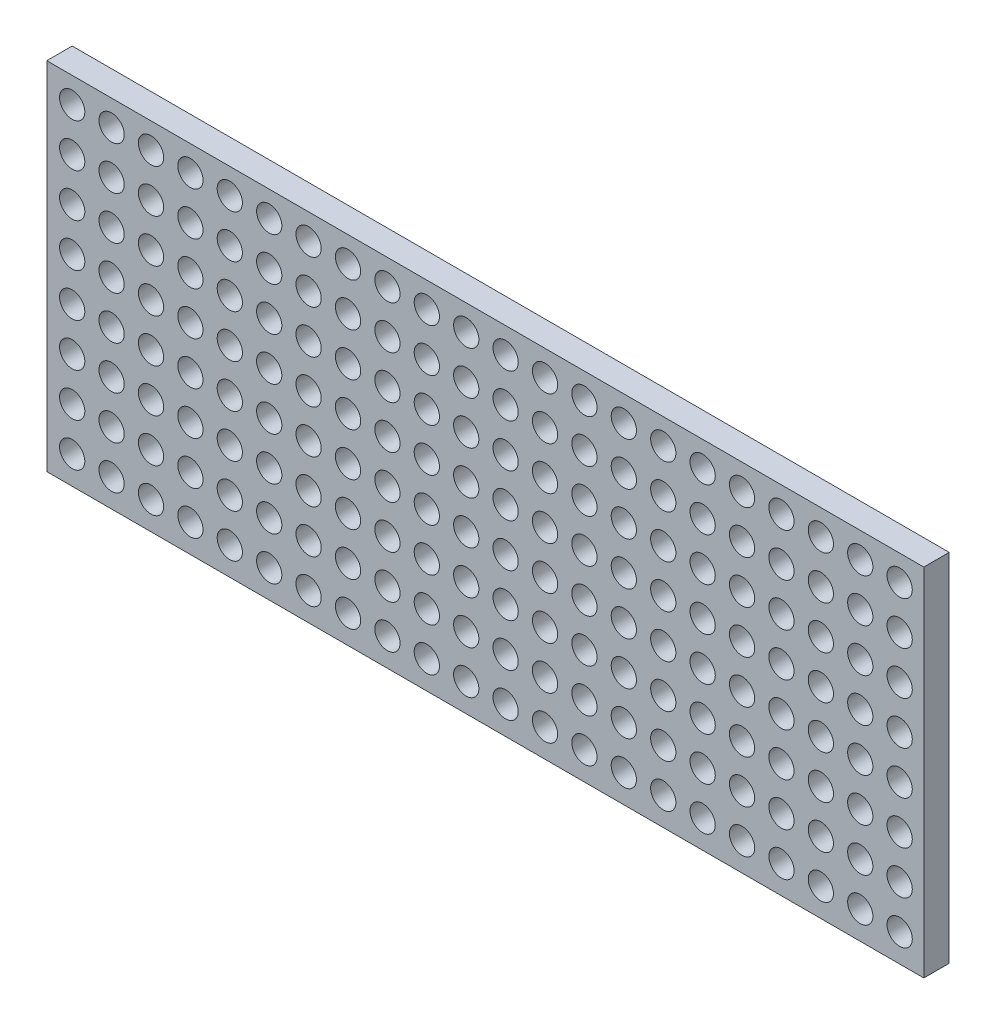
from build123d import *

# Parameters (mm, degrees)
SKETCH_1_W          = 6.9
SKETCH_1_H          = 2.8
EXTRUDE_1_DEPTH     = 0.2
SKETCH_2_R          = 0.09934996
CUT_EXTRUDE_1_DEPTH = 0.2


with BuildPart() as part:
    # Sketch 1 → Extrude 1 (new body)
    with BuildSketch(Plane.XY):
        Rectangle(SKETCH_1_W, SKETCH_1_H)
    extrude(amount=EXTRUDE_1_DEPTH)

    # Sketch 2 → Cut-Extrude 1 (cut)
    with BuildSketch(Plane.XY.offset(0.2)):
        with Locations((-3.25, 1.2)):
            Circle(SKETCH_2_R)
        with Locations((-2.94, 1.2)):
            Circle(SKETCH_2_R)
        with Locations((-2.63, 1.2)):
            Circle(SKETCH_2_R)
        with Locations((-2.32, 1.2)):
            Circle(SKETCH_2_R)
        with Locations((-2.01, 1.2)):
            Circle(SKETCH_2_R)
        with Locations((-1.7, 1.2)):
            Circle(SKETCH_2_R)
        with Locations((-1.39, 1.2)):
            Circle(SKETCH_2_R)
        with Locations((-1.08, 1.2)):
            Circle(SKETCH_2_R)
        with Locations((-0.77, 1.2)):
            Circle(SKETCH_2_R)
        with Locations((-0.46, 1.2)):
            Circle(SKETCH_2_R)
        with Locations((-0.15, 1.2)):
            Circle(SKETCH_2_R)
        with Locations((0.16, 1.2)):
            Circle(SKETCH_2_R)
        with Locations((0.47, 1.2)):
            Circle(SKETCH_2_R)
        with Locations((0.78, 1.2)):
            Circle(SKETCH_2_R)
        with Locations((1.09, 1.2)):
            Circle(SKETCH_2_R)
        with Locations((1.4, 1.2)):
            Circle(SKETCH_2_R)
        with Locations((1.71, 1.2)):
            Circle(SKETCH_2_R)
        with Locations((2.02, 1.2)):
            Circle(SKETCH_2_R)
        with Locations((2.33, 1.2)):
            Circle(SKETCH_2_R)
        with Locations((2.64, 1.2)):
            Circle(SKETCH_2_R)
        with Locations((2.95, 1.2)):
            Circle(SKETCH_2_R)
        with Locations((3.26, 1.2)):
            Circle(SKETCH_2_R)
        with Locations((-2.94, 0.86)):
            Circle(SKETCH_2_R)
        with Locations((-2.63, 0.86)):
            Circle(SKETCH_2_R)
        with Locations((-2.32, 0.86)):
            Circle(SKETCH_2_R)
        with Locations((-2.01, 0.86)):
            Circle(SKETCH_2_R)
        with Locations((-1.7, 0.86)):
            Circle(SKETCH_2_R)
        with Locations((-1.39, 0.86)):
            Circle(SKETCH_2_R)
        with Locations((-1.08, 0.86)):
            Circle(SKETCH_2_R)
        with Locations((-0.77, 0.86)):
            Circle(SKETCH_2_R)
        with Locations((-0.46, 0.86)):
            Circle(SKETCH_2_R)
        with Locations((-0.15, 0.86)):
            Circle(SKETCH_2_R)
        with Locations((0.16, 0.86)):
            Circle(SKETCH_2_R)
        with Locations((0.47, 0.86)):
            Circle(SKETCH_2_R)
        with Locations((0.78, 0.86)):
            Circle(SKETCH_2_R)
        with Locations((1.09, 0.86)):
            Circle(SKETCH_2_R)
        with Locations((1.4, 0.86)):
            Circle(SKETCH_2_R)
        with Locations((1.71, 0.86)):
            Circle(SKETCH_2_R)
        with Locations((2.02, 0.86)):
            Circle(SKETCH_2_R)
        with Locations((2.33, 0.86)):
            Circle(SKETCH_2_R)
        with Locations((2.64, 0.86)):
            Circle(SKETCH_2_R)
        with Locations((2.95, 0.86)):
            Circle(SKETCH_2_R)
        with Locations((3.26, 0.86)):
            Circle(SKETCH_2_R)
        with Locations((-2.94, 0.52)):
            Circle(SKETCH_2_R)
        with Locations((-2.63, 0.52)):
            Circle(SKETCH_2_R)
        with Locations((-2.32, 0.52)):
            Circle(SKETCH_2_R)
        with Locations((-2.01, 0.52)):
            Circle(SKETCH_2_R)
        with Locations((-1.7, 0.52)):
            Circle(SKETCH_2_R)
        with Locations((-1.39, 0.52)):
            Circle(SKETCH_2_R)
        with Locations((-1.08, 0.52)):
            Circle(SKETCH_2_R)
        with Locations((-0.77, 0.52)):
            Circle(SKETCH_2_R)
        with Locations((-0.46, 0.52)):
            Circle(SKETCH_2_R)
        with Locations((-0.15, 0.52)):
            Circle(SKETCH_2_R)
        with Locations((0.16, 0.52)):
            Circle(SKETCH_2_R)
        with Locations((0.47, 0.52)):
            Circle(SKETCH_2_R)
        with Locations((0.78, 0.52)):
            Circle(SKETCH_2_R)
        with Locations((1.09, 0.52)):
            Circle(SKETCH_2_R)
        with Locations((1.4, 0.52)):
            Circle(SKETCH_2_R)
        with Locations((1.71, 0.52)):
            Circle(SKETCH_2_R)
        with Locations((2.02, 0.52)):
            Circle(SKETCH_2_R)
        with Locations((2.33, 0.52)):
            Circle(SKETCH_2_R)
        with Locations((2.64, 0.52)):
            Circle(SKETCH_2_R)
        with Locations((2.95, 0.52)):
            Circle(SKETCH_2_R)
        with Locations((3.26, 0.52)):
            Circle(SKETCH_2_R)
        with Locations((-2.94, 0.18)):
            Circle(SKETCH_2_R)
        with Locations((-2.63, 0.18)):
            Circle(SKETCH_2_R)
        with Locations((-2.32, 0.18)):
            Circle(SKETCH_2_R)
        with Locations((-2.01, 0.18)):
            Circle(SKETCH_2_R)
        with Locations((-1.7, 0.18)):
            Circle(SKETCH_2_R)
        with Locations((-1.39, 0.18)):
            Circle(SKETCH_2_R)
        with Locations((-1.08, 0.18)):
            Circle(SKETCH_2_R)
        with Locations((-0.77, 0.18)):
            Circle(SKETCH_2_R)
        with Locations((-0.46, 0.18)):
            Circle(SKETCH_2_R)
        with Locations((-0.15, 0.18)):
            Circle(SKETCH_2_R)
        with Locations((0.16, 0.18)):
            Circle(SKETCH_2_R)
        with Locations((0.47, 0.18)):
            Circle(SKETCH_2_R)
        with Locations((0.78, 0.18)):
            Circle(SKETCH_2_R)
        with Locations((1.09, 0.18)):
            Circle(SKETCH_2_R)
        with Locations((1.4, 0.18)):
            Circle(SKETCH_2_R)
        with Locations((1.71, 0.18)):
            Circle(SKETCH_2_R)
        with Locations((2.02, 0.18)):
            Circle(SKETCH_2_R)
        with Locations((2.33, 0.18)):
            Circle(SKETCH_2_R)
        with Locations((2.64, 0.18)):
            Circle(SKETCH_2_R)
        with Locations((2.95, 0.18)):
            Circle(SKETCH_2_R)
        with Locations((3.26, 0.18)):
            Circle(SKETCH_2_R)
        with Locations((-2.94, -0.16)):
            Circle(SKETCH_2_R)
        with Locations((-2.63, -0.16)):
            Circle(SKETCH_2_R)
        with Locations((-2.32, -0.16)):
            Circle(SKETCH_2_R)
        with Locations((-2.01, -0.16)):
            Circle(SKETCH_2_R)
        with Locations((-1.7, -0.16)):
            Circle(SKETCH_2_R)
        with Locations((-1.39, -0.16)):
            Circle(SKETCH_2_R)
        with Locations((-1.08, -0.16)):
            Circle(SKETCH_2_R)
        with Locations((-0.77, -0.16)):
            Circle(SKETCH_2_R)
        with Locations((-0.46, -0.16)):
            Circle(SKETCH_2_R)
        with Locations((-0.15, -0.16)):
            Circle(SKETCH_2_R)
        with Locations((0.16, -0.16)):
            Circle(SKETCH_2_R)
        with Locations((0.47, -0.16)):
            Circle(SKETCH_2_R)
        with Locations((0.78, -0.16)):
            Circle(SKETCH_2_R)
        with Locations((1.09, -0.16)):
            Circle(SKETCH_2_R)
        with Locations((1.4, -0.16)):
            Circle(SKETCH_2_R)
        with Locations((1.71, -0.16)):
            Circle(SKETCH_2_R)
        with Locations((2.02, -0.16)):
            Circle(SKETCH_2_R)
        with Locations((2.33, -0.16)):
            Circle(SKETCH_2_R)
        with Locations((2.64, -0.16)):
            Circle(SKETCH_2_R)
        with Locations((2.95, -0.16)):
            Circle(SKETCH_2_R)
        with Locations((3.26, -0.16)):
            Circle(SKETCH_2_R)
        with Locations((-2.94, -0.5)):
            Circle(SKETCH_2_R)
        with Locations((-2.63, -0.5)):
            Circle(SKETCH_2_R)
        with Locations((-2.32, -0.5)):
            Circle(SKETCH_2_R)
        with Locations((-2.01, -0.5)):
            Circle(SKETCH_2_R)
        with Locations((-1.7, -0.5)):
            Circle(SKETCH_2_R)
        with Locations((-1.39, -0.5)):
            Circle(SKETCH_2_R)
        with Locations((-1.08, -0.5)):
            Circle(SKETCH_2_R)
        with Locations((-0.77, -0.5)):
            Circle(SKETCH_2_R)
        with Locations((-0.46, -0.5)):
            Circle(SKETCH_2_R)
        with Locations((-0.15, -0.5)):
            Circle(SKETCH_2_R)
        with Locations((0.16, -0.5)):
            Circle(SKETCH_2_R)
        with Locations((0.47, -0.5)):
            Circle(SKETCH_2_R)
        with Locations((0.78, -0.5)):
            Circle(SKETCH_2_R)
        with Locations((1.09, -0.5)):
            Circle(SKETCH_2_R)
        with Locations((1.4, -0.5)):
            Circle(SKETCH_2_R)
        with Locations((1.71, -0.5)):
            Circle(SKETCH_2_R)
        with Locations((2.02, -0.5)):
            Circle(SKETCH_2_R)
        with Locations((2.33, -0.5)):
            Circle(SKETCH_2_R)
        with Locations((2.64, -0.5)):
            Circle(SKETCH_2_R)
        with Locations((2.95, -0.5)):
            Circle(SKETCH_2_R)
        with Locations((3.26, -0.5)):
            Circle(SKETCH_2_R)
        with Locations((-2.94, -0.84)):
            Circle(SKETCH_2_R)
        with Locations((-2.63, -0.84)):
            Circle(SKETCH_2_R)
        with Locations((-2.32, -0.84)):
            Circle(SKETCH_2_R)
        with Locations((-2.01, -0.84)):
            Circle(SKETCH_2_R)
        with Locations((-1.7, -0.84)):
            Circle(SKETCH_2_R)
        with Locations((-1.39, -0.84)):
            Circle(SKETCH_2_R)
        with Locations((-1.08, -0.84)):
            Circle(SKETCH_2_R)
        with Locations((-0.77, -0.84)):
            Circle(SKETCH_2_R)
        with Locations((-0.46, -0.84)):
            Circle(SKETCH_2_R)
        with Locations((-0.15, -0.84)):
            Circle(SKETCH_2_R)
        with Locations((0.16, -0.84)):
            Circle(SKETCH_2_R)
        with Locations((0.47, -0.84)):
            Circle(SKETCH_2_R)
        with Locations((0.78, -0.84)):
            Circle(SKETCH_2_R)
        with Locations((1.09, -0.84)):
            Circle(SKETCH_2_R)
        with Locations((1.4, -0.84)):
            Circle(SKETCH_2_R)
        with Locations((1.71, -0.84)):
            Circle(SKETCH_2_R)
        with Locations((2.02, -0.84)):
            Circle(SKETCH_2_R)
        with Locations((2.33, -0.84)):
            Circle(SKETCH_2_R)
        with Locations((2.64, -0.84)):
            Circle(SKETCH_2_R)
        with Locations((2.95, -0.84)):
            Circle(SKETCH_2_R)
        with Locations((3.26, -0.84)):
            Circle(SKETCH_2_R)
        with Locations((-2.94, -1.18)):
            Circle(SKETCH_2_R)
        with Locations((-2.63, -1.18)):
            Circle(SKETCH_2_R)
        with Locations((-2.32, -1.18)):
            Circle(SKETCH_2_R)
        with Locations((-2.01, -1.18)):
            Circle(SKETCH_2_R)
        with Locations((-1.7, -1.18)):
            Circle(SKETCH_2_R)
        with Locations((-1.39, -1.18)):
            Circle(SKETCH_2_R)
        with Locations((-1.08, -1.18)):
            Circle(SKETCH_2_R)
        with Locations((-0.77, -1.18)):
            Circle(SKETCH_2_R)
        with Locations((-0.46, -1.18)):
            Circle(SKETCH_2_R)
        with Locations((-0.15, -1.18)):
            Circle(SKETCH_2_R)
        with Locations((0.16, -1.18)):
            Circle(SKETCH_2_R)
        with Locations((0.47, -1.18)):
            Circle(SKETCH_2_R)
        with Locations((0.78, -1.18)):
            Circle(SKETCH_2_R)
        with Locations((1.09, -1.18)):
            Circle(SKETCH_2_R)
        with Locations((1.4, -1.18)):
            Circle(SKETCH_2_R)
        with Locations((1.71, -1.18)):
            Circle(SKETCH_2_R)
        with Locations((2.02, -1.18)):
            Circle(SKETCH_2_R)
        with Locations((2.33, -1.18)):
            Circle(SKETCH_2_R)
        with Locations((2.64, -1.18)):
            Circle(SKETCH_2_R)
        with Locations((2.95, -1.18)):
            Circle(SKETCH_2_R)
        with Locations((3.26, -1.18)):
            Circle(SKETCH_2_R)
        with Locations((-3.25, 0.86)):
            Circle(SKETCH_2_R)
        with Locations((-3.25, 0.52)):
            Circle(SKETCH_2_R)
        with Locations((-3.25, 0.18)):
            Circle(SKETCH_2_R)
        with Locations((-3.25, -0.16)):
            Circle(SKETCH_2_R)
        with Locations((-3.25, -0.5)):
            Circle(SKETCH_2_R)
        with Locations((-3.25, -0.84)):
            Circle(SKETCH_2_R)
        with Locations((-3.25, -1.18)):
            Circle(SKETCH_2_R)
    extrude(amount=-CUT_EXTRUDE_1_DEPTH, mode=Mode.SUBTRACT)


solid = part.part
